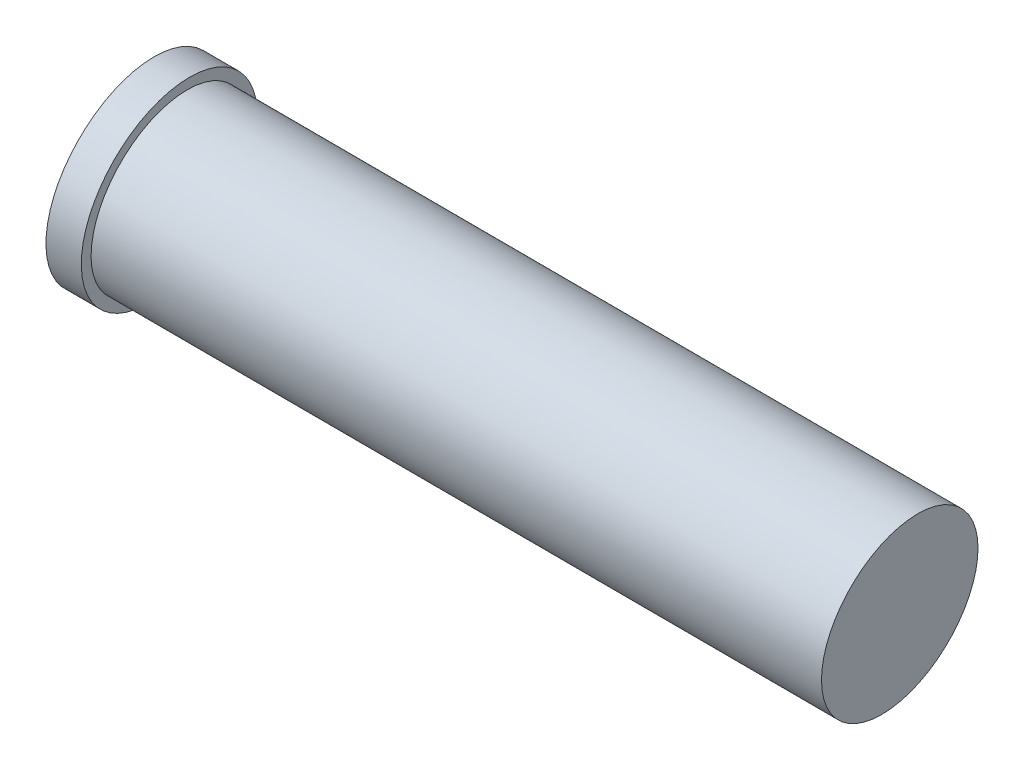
ISO-10303-21;
HEADER;
FILE_DESCRIPTION(('STEP AP214'),'2;1');
FILE_NAME('part.step','',(''),(''),'','','');
FILE_SCHEMA(('AUTOMOTIVE_DESIGN { 1 0 10303 214 1 1 1 1 }'));
ENDSEC;
DATA;
#1=APPLICATION_CONTEXT('core data for automotive mechanical design processes');
#2=APPLICATION_PROTOCOL_DEFINITION('international standard','automotive_design',2000,#1);
#3=PRODUCT_CONTEXT('',#1,'mechanical');
#4=PRODUCT('Part','Part','',(#3));
#5=PRODUCT_RELATED_PRODUCT_CATEGORY('part','',(#4));
#6=PRODUCT_DEFINITION_FORMATION('','',#4);
#7=PRODUCT_DEFINITION_CONTEXT('part definition',#1,'design');
#8=PRODUCT_DEFINITION('design','',#6,#7);
#9=PRODUCT_DEFINITION_SHAPE('','',#8);
#10=(LENGTH_UNIT() NAMED_UNIT(*) SI_UNIT(.MILLI.,.METRE.));
#11=(NAMED_UNIT(*) PLANE_ANGLE_UNIT() SI_UNIT($,.RADIAN.));
#12=(NAMED_UNIT(*) SI_UNIT($,.STERADIAN.) SOLID_ANGLE_UNIT());
#13=UNCERTAINTY_MEASURE_WITH_UNIT(LENGTH_MEASURE(1.E-05),#10,'distance_accuracy_value','');
#14=(GEOMETRIC_REPRESENTATION_CONTEXT(3) GLOBAL_UNCERTAINTY_ASSIGNED_CONTEXT((#13)) GLOBAL_UNIT_ASSIGNED_CONTEXT((#10,
#11,#12)) REPRESENTATION_CONTEXT('',''));
#15=CARTESIAN_POINT('',(0.,0.,0.));
#16=DIRECTION('',(0.,0.,1.));
#17=DIRECTION('',(1.,0.,0.));
#18=AXIS2_PLACEMENT_3D('',#15,#16,#17);
#19=CARTESIAN_POINT('',(379.480094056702,26.7979904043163,-39.1960093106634));
#20=DIRECTION('',(0.990047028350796,-0.101004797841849,-0.0980046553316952));
#21=DIRECTION('',(0.101493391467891,0.994836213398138,0.));
#22=AXIS2_PLACEMENT_3D('',#19,#20,#21);
#23=PLANE('',#22);
#24=CARTESIAN_POINT('',(379.480094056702,26.7979904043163,-39.1960093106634));
#25=DIRECTION('',(0.990047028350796,-0.101004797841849,-0.0980046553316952));
#26=DIRECTION('',(0.101493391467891,0.994836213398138,0.));
#27=AXIS2_PLACEMENT_3D('',#24,#25,#26);
#28=CIRCLE('',#27,16.);
#29=CARTESIAN_POINT('',(381.103988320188,42.7153698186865,-39.1960093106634));
#30=VERTEX_POINT('',#29);
#31=EDGE_CURVE('E57',#30,#30,#28,.T.);
#32=ORIENTED_EDGE('',*,*,#31,.T.);
#33=EDGE_LOOP('',(#32));
#34=FACE_BOUND('',#33,.T.);
#35=ADVANCED_FACE('F49',(#34),#23,.T.);
#36=CARTESIAN_POINT('',(250.773980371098,39.9286141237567,-26.455404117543));
#37=DIRECTION('',(0.990047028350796,-0.101004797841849,-0.0980046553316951));
#38=DIRECTION('',(0.101493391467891,0.994836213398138,0.));
#39=AXIS2_PLACEMENT_3D('',#36,#37,#38);
#40=CYLINDRICAL_SURFACE('',#39,16.);
#41=CARTESIAN_POINT('',(256.714262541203,39.3225853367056,-27.0434320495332));
#42=DIRECTION('',(0.990047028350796,-0.101004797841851,-0.0980046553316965));
#43=DIRECTION('',(0.101493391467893,0.994836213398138,0.));
#44=AXIS2_PLACEMENT_3D('',#41,#42,#43);
#45=CIRCLE('',#44,16.);
#46=CARTESIAN_POINT('',(258.338156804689,55.2399647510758,-27.0434320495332));
#47=VERTEX_POINT('',#46);
#48=EDGE_CURVE('E11',#47,#47,#45,.F.);
#49=ORIENTED_EDGE('',*,*,#48,.F.);
#50=EDGE_LOOP('',(#49));
#51=FACE_BOUND('',#50,.T.);
#52=ORIENTED_EDGE('',*,*,#31,.F.);
#53=EDGE_LOOP('',(#52));
#54=FACE_BOUND('',#53,.T.);
#55=ADVANCED_FACE('F90',(#51,#54),#40,.T.);
#56=CARTESIAN_POINT('',(256.714262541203,39.3225853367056,-27.0434320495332));
#57=DIRECTION('',(0.990047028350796,-0.101004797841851,-0.0980046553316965));
#58=DIRECTION('',(0.101493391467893,0.994836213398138,0.));
#59=AXIS2_PLACEMENT_3D('',#56,#57,#58);
#60=PLANE('',#59);
#61=ORIENTED_EDGE('',*,*,#48,.T.);
#62=EDGE_LOOP('',(#61));
#63=FACE_BOUND('',#62,.T.);
#64=CARTESIAN_POINT('',(256.714262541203,39.3225853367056,-27.0434320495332));
#65=DIRECTION('',(0.990047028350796,-0.101004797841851,-0.0980046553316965));
#66=DIRECTION('',(0.101493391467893,0.994836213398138,0.));
#67=AXIS2_PLACEMENT_3D('',#64,#65,#66);
#68=CIRCLE('',#67,18.);
#69=CARTESIAN_POINT('',(258.541143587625,57.229637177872,-27.0434320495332));
#70=VERTEX_POINT('',#69);
#71=EDGE_CURVE('E61',#70,#70,#68,.T.);
#72=ORIENTED_EDGE('',*,*,#71,.T.);
#73=EDGE_LOOP('',(#72));
#74=FACE_BOUND('',#73,.T.);
#75=ADVANCED_FACE('F89',(#63,#74),#60,.T.);
#76=CARTESIAN_POINT('',(250.773980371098,39.9286141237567,-26.455404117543));
#77=DIRECTION('',(0.990047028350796,-0.101004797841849,-0.098004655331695));
#78=DIRECTION('',(0.101493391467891,0.994836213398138,0.));
#79=AXIS2_PLACEMENT_3D('',#76,#77,#78);
#80=CYLINDRICAL_SURFACE('',#79,18.);
#81=ORIENTED_EDGE('',*,*,#71,.F.);
#82=EDGE_LOOP('',(#81));
#83=FACE_BOUND('',#82,.T.);
#84=CARTESIAN_POINT('',(250.773980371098,39.9286141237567,-26.455404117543));
#85=DIRECTION('',(0.990047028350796,-0.101004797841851,-0.0980046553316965));
#86=DIRECTION('',(0.101493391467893,0.994836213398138,0.));
#87=AXIS2_PLACEMENT_3D('',#84,#85,#86);
#88=CIRCLE('',#87,18.);
#89=CARTESIAN_POINT('',(252.60086141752,57.8356659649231,-26.455404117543));
#90=VERTEX_POINT('',#89);
#91=EDGE_CURVE('E66',#90,#90,#88,.T.);
#92=ORIENTED_EDGE('',*,*,#91,.T.);
#93=EDGE_LOOP('',(#92));
#94=FACE_BOUND('',#93,.T.);
#95=ADVANCED_FACE('F88',(#83,#94),#80,.T.);
#96=CARTESIAN_POINT('',(250.773980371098,39.9286141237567,-26.455404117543));
#97=DIRECTION('',(0.990047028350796,-0.101004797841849,-0.0980046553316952));
#98=DIRECTION('',(0.101493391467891,0.994836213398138,0.));
#99=AXIS2_PLACEMENT_3D('',#96,#97,#98);
#100=PLANE('',#99);
#101=CARTESIAN_POINT('',(250.773980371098,39.9286141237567,-26.455404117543));
#102=DIRECTION('',(0.990047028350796,-0.101004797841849,-0.0980046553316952));
#103=DIRECTION('',(0.101493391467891,0.994836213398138,0.));
#104=AXIS2_PLACEMENT_3D('',#101,#102,#103);
#105=CIRCLE('',#104,11.1);
#106=CARTESIAN_POINT('',(251.900557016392,50.971296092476,-26.455404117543));
#107=VERTEX_POINT('',#106);
#108=EDGE_CURVE('E53',#107,#107,#105,.T.);
#109=ORIENTED_EDGE('',*,*,#108,.T.);
#110=EDGE_LOOP('',(#109));
#111=FACE_BOUND('',#110,.T.);
#112=ORIENTED_EDGE('',*,*,#91,.F.);
#113=EDGE_LOOP('',(#112));
#114=FACE_BOUND('',#113,.T.);
#115=ADVANCED_FACE('F51',(#111,#114),#100,.F.);
#116=CARTESIAN_POINT('',(249.783933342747,40.0296189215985,-26.3573994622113));
#117=DIRECTION('',(0.990047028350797,-0.101004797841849,-0.098004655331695));
#118=DIRECTION('',(0.101493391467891,0.994836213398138,0.));
#119=AXIS2_PLACEMENT_3D('',#116,#117,#118);
#120=CYLINDRICAL_SURFACE('',#119,11.1);
#121=CARTESIAN_POINT('',(377.5,27.,-39.));
#122=DIRECTION('',(0.990047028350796,-0.101004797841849,-0.098004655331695));
#123=DIRECTION('',(0.101493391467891,0.994836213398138,0.));
#124=AXIS2_PLACEMENT_3D('',#121,#122,#123);
#125=CIRCLE('',#124,11.1);
#126=CARTESIAN_POINT('',(378.626576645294,38.0426819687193,-39.));
#127=VERTEX_POINT('',#126);
#128=EDGE_CURVE('E69',#127,#127,#125,.T.);
#129=ORIENTED_EDGE('',*,*,#128,.T.);
#130=EDGE_LOOP('',(#129));
#131=FACE_BOUND('',#130,.T.);
#132=ORIENTED_EDGE('',*,*,#108,.F.);
#133=EDGE_LOOP('',(#132));
#134=FACE_BOUND('',#133,.T.);
#135=ADVANCED_FACE('F78',(#131,#134),#120,.F.);
#136=CARTESIAN_POINT('',(377.5,27.,-39.));
#137=DIRECTION('',(0.990047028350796,-0.101004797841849,-0.098004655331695));
#138=DIRECTION('',(0.101493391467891,0.994836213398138,0.));
#139=AXIS2_PLACEMENT_3D('',#136,#137,#138);
#140=PLANE('',#139);
#141=ORIENTED_EDGE('',*,*,#128,.F.);
#142=EDGE_LOOP('',(#141));
#143=FACE_BOUND('',#142,.T.);
#144=ADVANCED_FACE('F80',(#143),#140,.F.);
#145=CLOSED_SHELL('',(#35,#55,#75,#95,#115,#135,#144));
#146=MANIFOLD_SOLID_BREP('B2',#145);
#147=ADVANCED_BREP_SHAPE_REPRESENTATION('',(#18,#146),#14);
#148=SHAPE_DEFINITION_REPRESENTATION(#9,#147);
ENDSEC;
END-ISO-10303-21;
